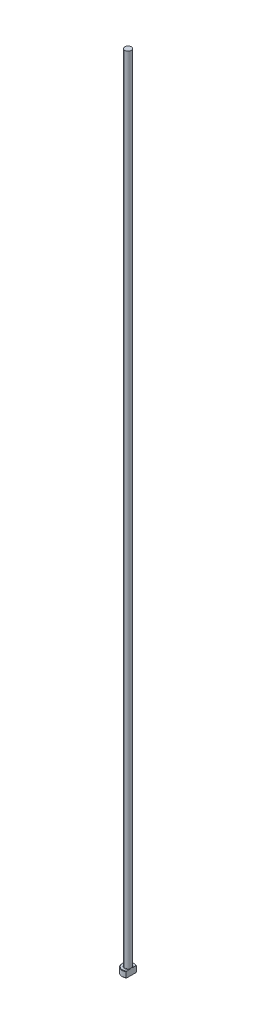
from build123d import *
from build123d.topology import SkipClean

# Parameters (mm, degrees)
CHAMFER1_SIZE = 0.2
FILLET1_R     = 0.2
KEY_DEPTH     = 401.022499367


with BuildPart() as part:
    # Sketch1 → Revolve1 (revolve)
    with BuildSketch(Plane.XY, mode=Mode.PRIVATE) as revolve1_sk:
        Polygon((0, 0), (-3, 0), (-3, 3), (-1.6, 3), (-1.6, 400), (0, 400), align=None)
    revolve(revolve1_sk.sketch.rotate(Axis((0, 259.958771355, 0), (0, -1, 0)), 270), axis=Axis((0, 259.958771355, 0), (0, -1, 0)))

    # Chamfer1
    chamfer1_edges = [part.edges().sort_by_distance(p)[0] for p in [
        (0, 3, -3),
        (0, 0, -3),
    ]]
    chamfer(chamfer1_edges, length=CHAMFER1_SIZE)

    # Fillet1
    fillet1_edges = [part.edges().sort_by_distance(p)[0] for p in [
        (0, 3, -1.6),
    ]]
    fillet(fillet1_edges, radius=FILLET1_R)

    # Sketch2 → KEY (cut, through all)
    with SkipClean():  # the faces are left unmerged after this step: merging them gives an invalid solid
        with BuildSketch(Plane(origin=(0, 0, 0), x_dir=(1, 0, 0), z_dir=(0, 1, 0))):
            with BuildLine():
                Line((1.6, 2.537715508), (1.6, -2.537715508))
                ThreePointArc((1.6, -2.537715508), (3, 0), (1.6, 2.537715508))
            make_face()
        extrude(amount=KEY_DEPTH, mode=Mode.SUBTRACT)


solid = part.part
